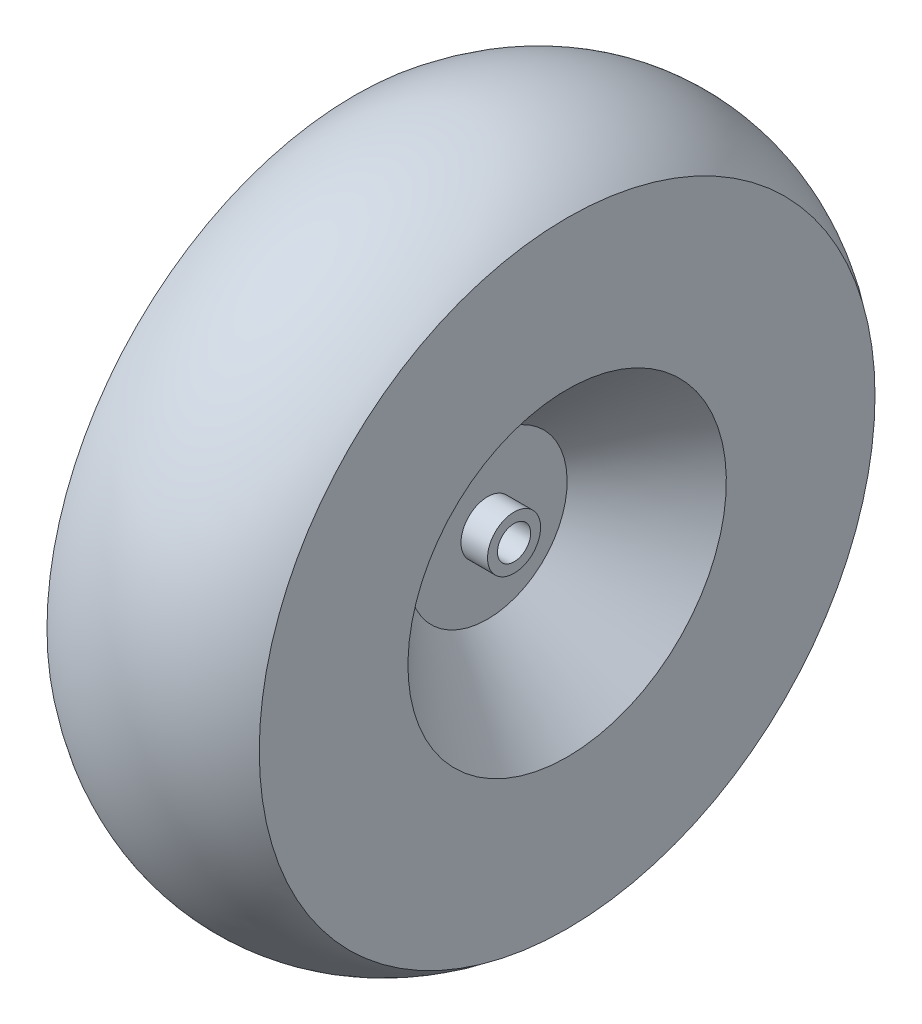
from build123d import *


with BuildPart() as part:
    # Sketch7 → Revolve6 (revolve)
    with BuildSketch(Plane.XY, mode=Mode.PRIVATE) as revolve6_sk:
        with BuildLine():
            Line((50.8, 76.2), (50.8, 147.35865108))
            add(Edge.make_bspline(
                [(50.8, 147.35865108), (0, 187.484544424), (-50.8, 147.35865108)],
                knots=[2.485810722, 2.485810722, 2.485810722, 3.797374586, 3.797374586, 3.797374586], degree=2, weights=[1, 0.792571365, 1]))
            Line((-50.8, 147.35865108), (-50.8, 76.2))
            Line((-50.8, 76.2), (-12.7, 38.1))
            Line((-12.7, 38.1), (-12.7, 12.7))
            Line((-12.7, 12.7), (-25.4, 12.7))
            Line((-25.4, 12.7), (-25.4, 7.9375))
            Line((-25.4, 7.9375), (25.4, 7.9375))
            Line((25.4, 7.9375), (25.4, 12.7))
            Line((25.4, 12.7), (12.7, 12.7))
            Line((12.7, 12.7), (12.7, 38.1))
            Line((12.7, 38.1), (50.8, 76.2))
        make_face()
    revolve(revolve6_sk.sketch.rotate(Axis((-25.4, 0, 0), (1, 0, 0)), 180), axis=Axis((-25.4, 0, 0), (1, 0, 0)))


solid = part.part
